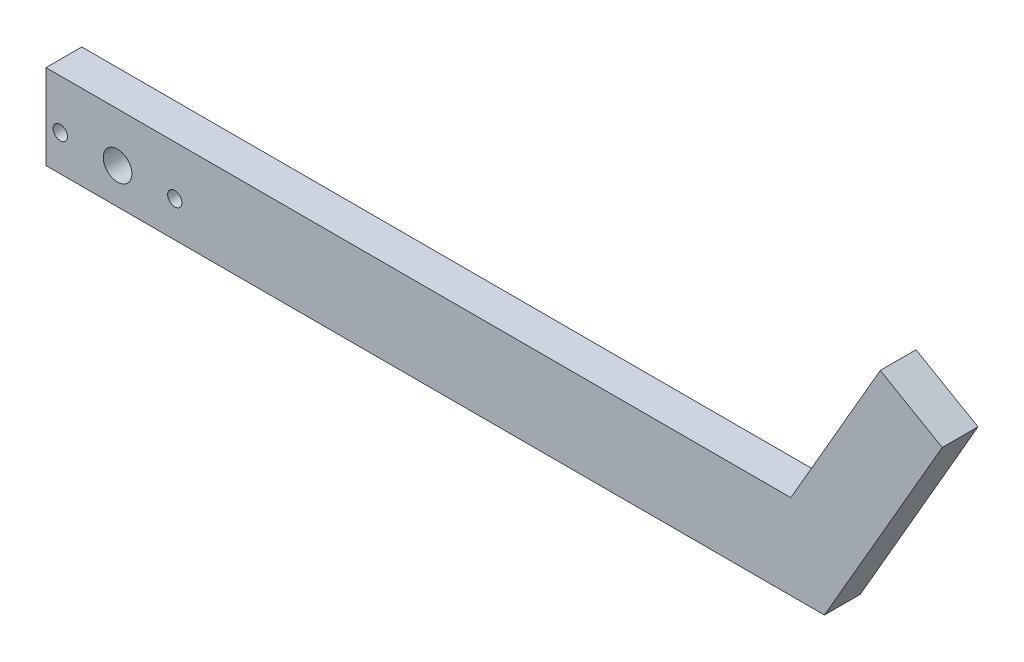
from build123d import *

# Parameters (mm, degrees)
BOSS_EXTRUDE1_DEPTH = 5
SKETCH2_R           = 2
SKETCH2_R_2         = 1
CUT_EXTRUDE1_DEPTH  = 5


with BuildPart() as part:
    # Sketch1 → Boss-Extrude1 (new body)
    with BuildSketch(Plane.XY):
        Polygon((54.109455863, 6.864286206), (66.609455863, 28.514921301), (75.2697099, 23.514921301), (58.806612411, -5), (48.877635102, -5), (-50, -5), (-50, 6.864286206), align=None)
    extrude(amount=BOSS_EXTRUDE1_DEPTH)

    # Sketch2 → Cut-Extrude1 (cut)
    with BuildSketch(Plane.XY.offset(5)):
        with Locations((-40, 0)):
            Circle(SKETCH2_R)
        with Locations((-48, 0)):
            Circle(SKETCH2_R_2)
        with Locations((-32, 0)):
            Circle(SKETCH2_R_2)
    extrude(amount=-CUT_EXTRUDE1_DEPTH, mode=Mode.SUBTRACT)


solid = part.part
